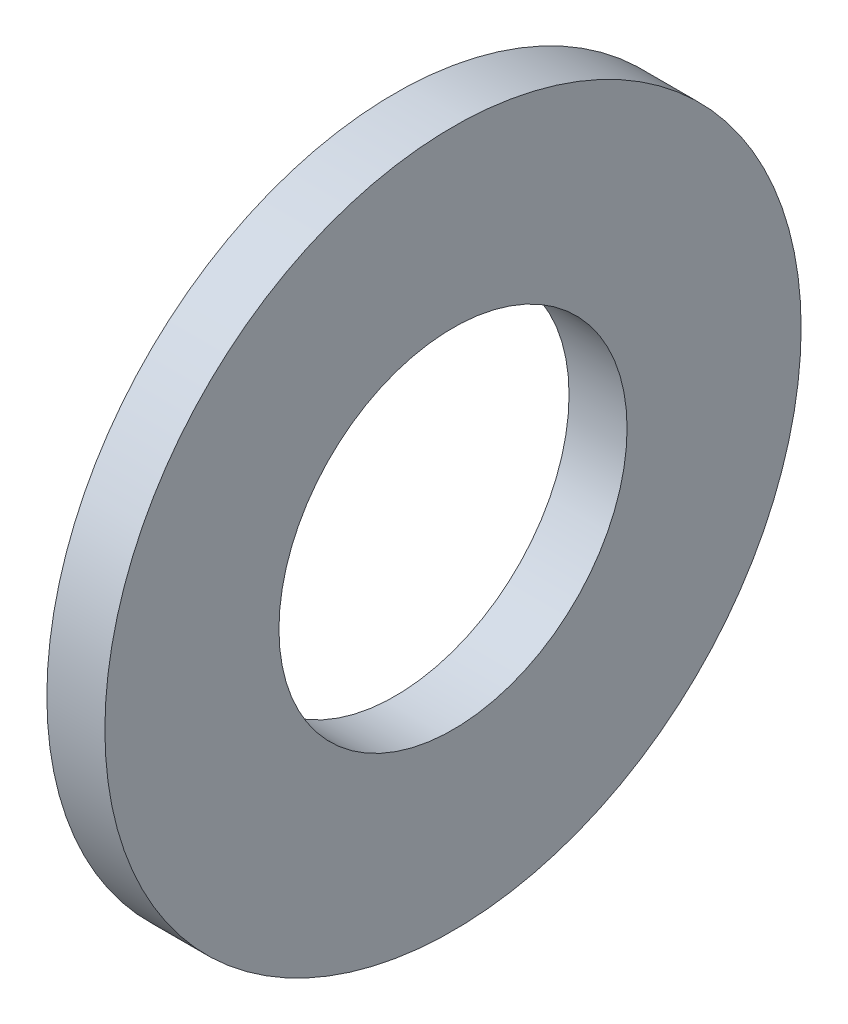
from build123d import *

# Parameters (mm, degrees)
ESQUISSE1_W = 2.5
ESQUISSE1_H = 7.5


with BuildPart() as part:
    # Esquisse1 → Base-R_volution (revolve)
    with BuildSketch(Plane(origin=(0, 0, 0), x_dir=(1, 0, 0), z_dir=(0, 1, 0)), mode=Mode.PRIVATE) as base_r_volution_sk:
        with Locations((1.25, 11.25)):
            Rectangle(ESQUISSE1_W, ESQUISSE1_H)
    revolve(base_r_volution_sk.sketch.rotate(Axis((0, 0, 0), (1, 0, 0)), 180), axis=Axis((0, 0, 0), (1, 0, 0)))


solid = part.part
